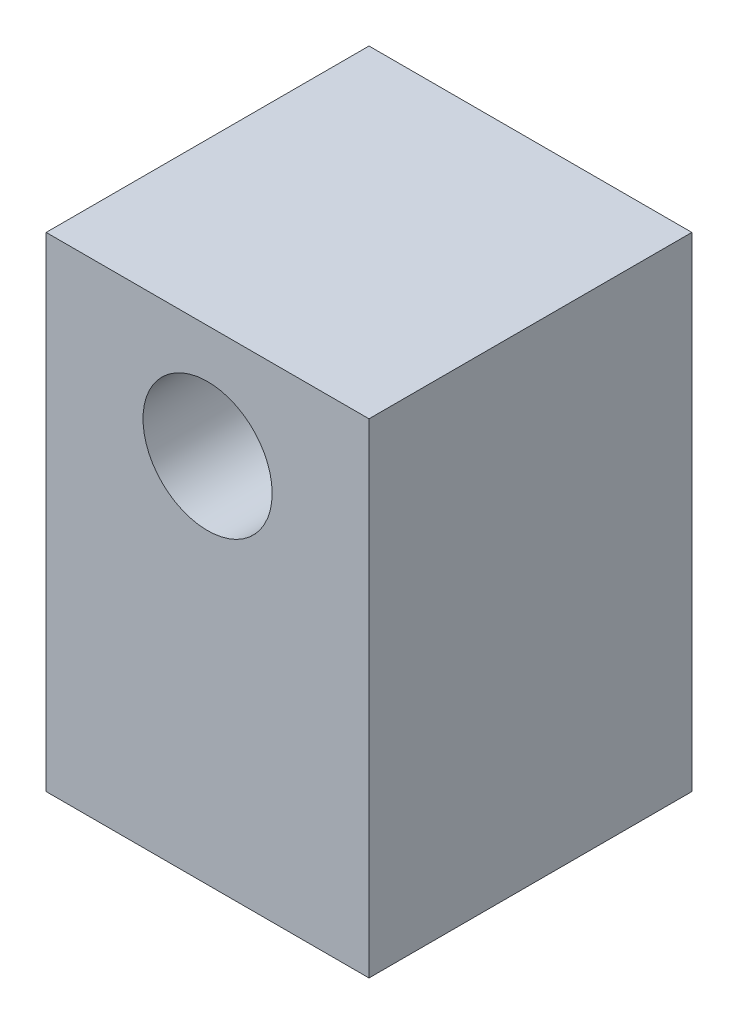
from build123d import *

# Parameters (mm, degrees)
SKETCH2_W           = 100
SKETCH2_H           = 150
SKETCH2_R           = 20
BOSS_EXTRUDE1_DEPTH = 50


with BuildPart() as part:
    # Sketch2 → Boss-Extrude1 (new, symmetric)
    with BuildSketch(Plane.XY):
        Rectangle(SKETCH2_W, SKETCH2_H)
        with Locations((0, 40)):
            Circle(SKETCH2_R, mode=Mode.SUBTRACT)
    extrude(amount=BOSS_EXTRUDE1_DEPTH, both=True)


solid = part.part
